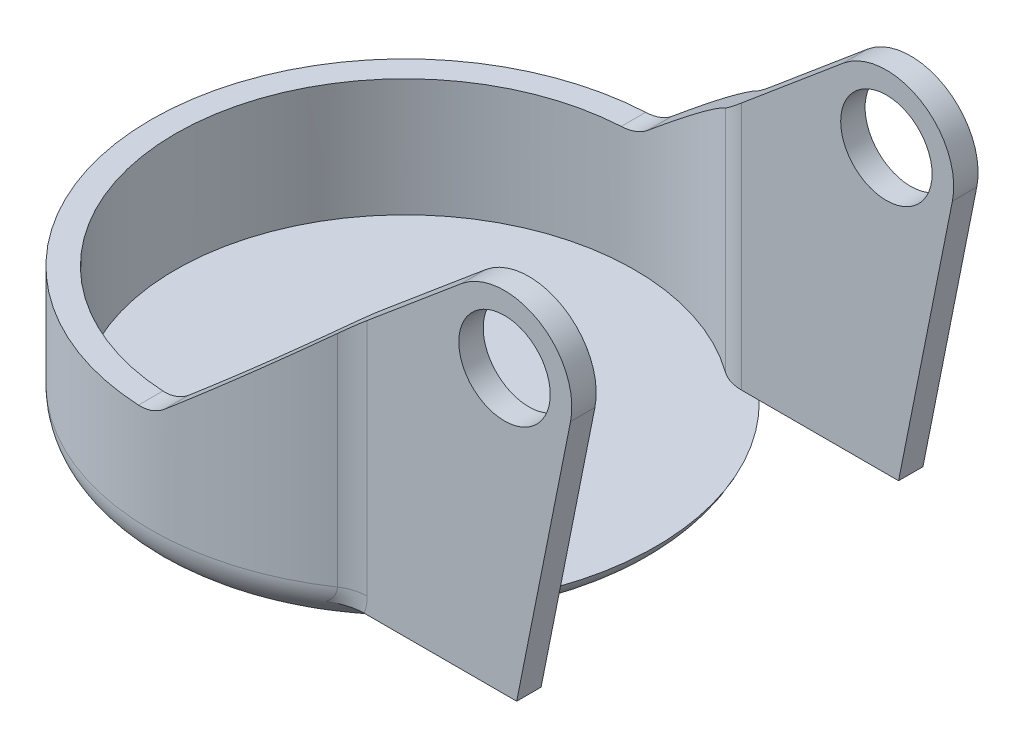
ISO-10303-21;
HEADER;
FILE_DESCRIPTION(('STEP AP214'),'2;1');
FILE_NAME('part.step','',(''),(''),'','','');
FILE_SCHEMA(('AUTOMOTIVE_DESIGN { 1 0 10303 214 1 1 1 1 }'));
ENDSEC;
DATA;
#1=APPLICATION_CONTEXT('core data for automotive mechanical design processes');
#2=APPLICATION_PROTOCOL_DEFINITION('international standard','automotive_design',2000,#1);
#3=PRODUCT_CONTEXT('',#1,'mechanical');
#4=PRODUCT('Part','Part','',(#3));
#5=PRODUCT_RELATED_PRODUCT_CATEGORY('part','',(#4));
#6=PRODUCT_DEFINITION_FORMATION('','',#4);
#7=PRODUCT_DEFINITION_CONTEXT('part definition',#1,'design');
#8=PRODUCT_DEFINITION('design','',#6,#7);
#9=PRODUCT_DEFINITION_SHAPE('','',#8);
#10=(LENGTH_UNIT() NAMED_UNIT(*) SI_UNIT(.MILLI.,.METRE.));
#11=(NAMED_UNIT(*) PLANE_ANGLE_UNIT() SI_UNIT($,.RADIAN.));
#12=(NAMED_UNIT(*) SI_UNIT($,.STERADIAN.) SOLID_ANGLE_UNIT());
#13=UNCERTAINTY_MEASURE_WITH_UNIT(LENGTH_MEASURE(1.E-05),#10,'distance_accuracy_value','');
#14=(GEOMETRIC_REPRESENTATION_CONTEXT(3) GLOBAL_UNCERTAINTY_ASSIGNED_CONTEXT((#13)) GLOBAL_UNIT_ASSIGNED_CONTEXT((#10,
#11,#12)) REPRESENTATION_CONTEXT('',''));
#15=CARTESIAN_POINT('',(0.,0.,0.));
#16=DIRECTION('',(0.,0.,1.));
#17=DIRECTION('',(1.,0.,0.));
#18=AXIS2_PLACEMENT_3D('',#15,#16,#17);
#19=CARTESIAN_POINT('',(0.,1.2,0.));
#20=DIRECTION('',(0.,-1.,0.));
#21=DIRECTION('',(0.,0.,-1.));
#22=AXIS2_PLACEMENT_3D('',#19,#20,#21);
#23=CYLINDRICAL_SURFACE('',#22,12.5);
#24=CARTESIAN_POINT('',(0.,6.92400870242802,0.));
#25=DIRECTION('',(0.64278760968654,-0.766044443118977,0.));
#26=DIRECTION('',(-0.766044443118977,-0.64278760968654,0.));
#27=AXIS2_PLACEMENT_3D('',#24,#25,#26);
#28=ELLIPSE('',#27,16.3175911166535,12.5);
#29=CARTESIAN_POINT('',(0.64819765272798,7.46791111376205,-12.4831822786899));
#30=VERTEX_POINT('',#29);
#31=CARTESIAN_POINT('',(7.01673301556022,12.8117467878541,-10.3448275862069));
#32=VERTEX_POINT('',#31);
#33=EDGE_CURVE('E239',#30,#32,#28,.T.);
#34=ORIENTED_EDGE('',*,*,#33,.T.);
#35=DIRECTION('',(0.,-1.,0.));
#36=VECTOR('',#35,1.);
#37=CARTESIAN_POINT('',(7.01673301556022,1.2,-10.3448275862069));
#38=LINE('',#37,#36);
#39=CARTESIAN_POINT('',(7.01673301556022,2.,-10.3448275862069));
#40=VERTEX_POINT('',#39);
#41=EDGE_CURVE('E419',#32,#40,#38,.T.);
#42=ORIENTED_EDGE('',*,*,#41,.T.);
#43=CARTESIAN_POINT('',(0.,2.,0.));
#44=DIRECTION('',(0.,1.,0.));
#45=DIRECTION('',(0.,0.,1.));
#46=AXIS2_PLACEMENT_3D('',#43,#44,#45);
#47=CIRCLE('',#46,12.5);
#48=CARTESIAN_POINT('',(7.01673301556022,2.,10.3448275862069));
#49=VERTEX_POINT('',#48);
#50=EDGE_CURVE('E300',#40,#49,#47,.T.);
#51=ORIENTED_EDGE('',*,*,#50,.T.);
#52=DIRECTION('',(0.,-1.,0.));
#53=VECTOR('',#52,1.);
#54=CARTESIAN_POINT('',(7.01673301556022,1.2,10.3448275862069));
#55=LINE('',#54,#53);
#56=CARTESIAN_POINT('',(7.01673301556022,12.8117467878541,10.3448275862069));
#57=VERTEX_POINT('',#56);
#58=EDGE_CURVE('E417',#49,#57,#55,.F.);
#59=ORIENTED_EDGE('',*,*,#58,.T.);
#60=CARTESIAN_POINT('',(0.64819765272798,7.46791111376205,12.4831822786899));
#61=VERTEX_POINT('',#60);
#62=EDGE_CURVE('E240',#57,#61,#28,.T.);
#63=ORIENTED_EDGE('',*,*,#62,.T.);
#64=CARTESIAN_POINT('',(0.648197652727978,7.46791111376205,12.4831822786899));
#65=CARTESIAN_POINT('',(0.604799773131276,7.43149949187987,12.4854357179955));
#66=CARTESIAN_POINT('',(0.559878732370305,7.3969476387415,12.4875408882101));
#67=CARTESIAN_POINT('',(0.467262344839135,7.33177220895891,12.4913498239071));
#68=CARTESIAN_POINT('',(0.419567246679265,7.30114828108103,12.4930536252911));
#69=CARTESIAN_POINT('',(0.275622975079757,7.2171677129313,12.4973201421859));
#70=CARTESIAN_POINT('',(0.175902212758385,7.16952353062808,12.4991832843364));
#71=CARTESIAN_POINT('',(0.0173507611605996,7.10925875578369,12.5001132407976));
#72=CARTESIAN_POINT('',(-0.0392796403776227,7.09059312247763,12.5000701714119));
#73=CARTESIAN_POINT('',(-0.154000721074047,7.05837944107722,12.4991826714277));
#74=CARTESIAN_POINT('',(-0.21209158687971,7.04483205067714,12.4983381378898));
#75=CARTESIAN_POINT('',(-0.331113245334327,7.02263214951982,12.4957597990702));
#76=CARTESIAN_POINT('',(-0.392075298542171,7.01415100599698,12.4939982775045));
#77=CARTESIAN_POINT('',(-0.514491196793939,7.00283039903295,12.4895590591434));
#78=CARTESIAN_POINT('',(-0.57594506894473,6.99999124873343,12.4868813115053));
#79=CARTESIAN_POINT('',(-0.637377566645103,7.,12.4837394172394));
#80=B_SPLINE_CURVE_WITH_KNOTS('',3,(#64,#65,#66,#67,#68,#69,#70,#71,#72,#73,#74,#75,#76,#77,#78,
#79),.UNSPECIFIED.,.F.,.F.,(4,2,2,2,2,2,2,4),(0.,0.169962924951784,0.33991064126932,
0.66971600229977,0.848404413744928,1.02711577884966,1.21157252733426,1.39603951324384),.UNSPECIFIED.);
#81=CARTESIAN_POINT('',(-0.637377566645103,7.,12.4837394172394));
#82=VERTEX_POINT('',#81);
#83=EDGE_CURVE('E489',#61,#82,#80,.T.);
#84=ORIENTED_EDGE('',*,*,#83,.T.);
#85=CARTESIAN_POINT('',(0.,7.,0.));
#86=DIRECTION('',(0.,-1.,0.));
#87=DIRECTION('',(0.,0.,-1.));
#88=AXIS2_PLACEMENT_3D('',#85,#86,#87);
#89=CIRCLE('',#88,12.5);
#90=CARTESIAN_POINT('',(-0.637377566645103,7.,-12.4837394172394));
#91=VERTEX_POINT('',#90);
#92=EDGE_CURVE('E263',#82,#91,#89,.T.);
#93=ORIENTED_EDGE('',*,*,#92,.T.);
#94=CARTESIAN_POINT('',(-0.637377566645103,7.,-12.4837394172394));
#95=CARTESIAN_POINT('',(-0.580944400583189,6.99999787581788,-12.4866232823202));
#96=CARTESIAN_POINT('',(-0.524513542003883,7.00238937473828,-12.4891178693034));
#97=CARTESIAN_POINT('',(-0.412035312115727,7.01193420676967,-12.4933334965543));
#98=CARTESIAN_POINT('',(-0.355987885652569,7.01908683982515,-12.4950546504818));
#99=CARTESIAN_POINT('',(-0.192258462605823,7.04708599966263,-12.4989874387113));
#100=CARTESIAN_POINT('',(-0.085607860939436,7.07448491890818,-12.5001370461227));
#101=CARTESIAN_POINT('',(0.131022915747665,7.14963845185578,-12.4998234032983));
#102=CARTESIAN_POINT('',(0.240453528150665,7.19898879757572,-12.4981183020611));
#103=CARTESIAN_POINT('',(0.398235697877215,7.28788823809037,-12.4937715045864));
#104=CARTESIAN_POINT('',(0.450546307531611,7.32064727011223,-12.4919807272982));
#105=CARTESIAN_POINT('',(0.551908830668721,7.39084039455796,-12.487912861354));
#106=CARTESIAN_POINT('',(0.600960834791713,7.42827435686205,-12.4856357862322));
#107=CARTESIAN_POINT('',(0.648197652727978,7.46791111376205,-12.4831822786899));
#108=B_SPLINE_CURVE_WITH_KNOTS('',3,(#94,#95,#96,#97,#98,#99,#100,#101,#102,#103,#104,#105,#106,
#107),.UNSPECIFIED.,.F.,.F.,(4,2,2,2,2,2,4),(0.,0.169424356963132,0.338823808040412,
0.667598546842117,1.02565764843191,1.21066859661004,1.39567439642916),.UNSPECIFIED.);
#109=EDGE_CURVE('E483',#91,#30,#108,.T.);
#110=ORIENTED_EDGE('',*,*,#109,.T.);
#111=EDGE_LOOP('',(#34,#42,#51,#59,#63,#84,#93,#110));
#112=FACE_BOUND('',#111,.T.);
#113=ADVANCED_FACE('F45',(#112),#23,.T.);
#114=CARTESIAN_POINT('',(0.,1.2,0.));
#115=DIRECTION('',(0.,1.,0.));
#116=DIRECTION('',(0.,0.,1.));
#117=AXIS2_PLACEMENT_3D('',#114,#115,#116);
#118=PLANE('',#117);
#119=CARTESIAN_POINT('',(0.,1.2,0.));
#120=DIRECTION('',(0.,1.,0.));
#121=DIRECTION('',(0.,0.,1.));
#122=AXIS2_PLACEMENT_3D('',#119,#120,#121);
#123=CIRCLE('',#122,2.5);
#124=CARTESIAN_POINT('',(0.,1.2,2.5));
#125=VERTEX_POINT('',#124);
#126=EDGE_CURVE('E533',#125,#125,#123,.T.);
#127=ORIENTED_EDGE('',*,*,#126,.F.);
#128=EDGE_LOOP('',(#127));
#129=FACE_BOUND('',#128,.T.);
#130=DIRECTION('',(-1.,0.,0.));
#131=VECTOR('',#130,1.);
#132=CARTESIAN_POINT('',(8.66477828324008,1.2,8.8));
#133=LINE('',#132,#131);
#134=CARTESIAN_POINT('',(8.64081222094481,1.2,8.8));
#135=VERTEX_POINT('',#134);
#136=CARTESIAN_POINT('',(7.76208734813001,1.2,8.8));
#137=VERTEX_POINT('',#136);
#138=EDGE_CURVE('E284',#135,#137,#133,.T.);
#139=ORIENTED_EDGE('',*,*,#138,.F.);
#140=CARTESIAN_POINT('',(0.,1.2,0.));
#141=DIRECTION('',(0.,1.,0.));
#142=DIRECTION('',(0.,0.,1.));
#143=AXIS2_PLACEMENT_3D('',#140,#141,#142);
#144=CIRCLE('',#143,12.3330302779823);
#145=CARTESIAN_POINT('',(8.64081222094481,1.2,-8.8));
#146=VERTEX_POINT('',#145);
#147=EDGE_CURVE('E303',#135,#146,#144,.T.);
#148=ORIENTED_EDGE('',*,*,#147,.T.);
#149=DIRECTION('',(1.,0.,0.));
#150=VECTOR('',#149,1.);
#151=CARTESIAN_POINT('',(7.08872343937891,1.2,-8.8));
#152=LINE('',#151,#150);
#153=CARTESIAN_POINT('',(7.76208734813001,1.2,-8.8));
#154=VERTEX_POINT('',#153);
#155=EDGE_CURVE('E288',#154,#146,#152,.T.);
#156=ORIENTED_EDGE('',*,*,#155,.F.);
#157=CARTESIAN_POINT('',(7.76208734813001,1.2,-10.8));
#158=DIRECTION('',(0.,1.,0.));
#159=DIRECTION('',(0.,0.,1.));
#160=AXIS2_PLACEMENT_3D('',#157,#158,#159);
#161=CIRCLE('',#160,2.);
#162=CARTESIAN_POINT('',(6.59485616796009,1.2,-9.17593984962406));
#163=VERTEX_POINT('',#162);
#164=EDGE_CURVE('E67',#154,#163,#161,.F.);
#165=ORIENTED_EDGE('',*,*,#164,.T.);
#166=CARTESIAN_POINT('',(0.,1.2,0.));
#167=DIRECTION('',(0.,-1.,0.));
#168=DIRECTION('',(0.,0.,1.));
#169=AXIS2_PLACEMENT_3D('',#166,#167,#168);
#170=CIRCLE('',#169,11.3);
#171=CARTESIAN_POINT('',(6.59485616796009,1.2,9.17593984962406));
#172=VERTEX_POINT('',#171);
#173=EDGE_CURVE('E283',#172,#163,#170,.T.);
#174=ORIENTED_EDGE('',*,*,#173,.F.);
#175=CARTESIAN_POINT('',(7.76208734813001,1.2,10.8));
#176=DIRECTION('',(0.,1.,0.));
#177=DIRECTION('',(0.,0.,1.));
#178=AXIS2_PLACEMENT_3D('',#175,#176,#177);
#179=CIRCLE('',#178,2.);
#180=EDGE_CURVE('E75',#172,#137,#179,.F.);
#181=ORIENTED_EDGE('',*,*,#180,.T.);
#182=EDGE_LOOP('',(#139,#148,#156,#165,#174,#181));
#183=FACE_BOUND('',#182,.T.);
#184=ADVANCED_FACE('F382',(#129,#183),#118,.T.);
#185=CARTESIAN_POINT('',(0.,0.,0.));
#186=DIRECTION('',(0.,1.,0.));
#187=DIRECTION('',(0.,0.,1.));
#188=AXIS2_PLACEMENT_3D('',#185,#186,#187);
#189=PLANE('',#188);
#190=CARTESIAN_POINT('',(0.,0.,0.));
#191=DIRECTION('',(0.,-1.,0.));
#192=DIRECTION('',(0.,0.,-1.));
#193=AXIS2_PLACEMENT_3D('',#190,#191,#192);
#194=CIRCLE('',#193,2.5);
#195=CARTESIAN_POINT('',(0.,0.,-2.5));
#196=VERTEX_POINT('',#195);
#197=EDGE_CURVE('E537',#196,#196,#194,.T.);
#198=ORIENTED_EDGE('',*,*,#197,.F.);
#199=EDGE_LOOP('',(#198));
#200=FACE_BOUND('',#199,.T.);
#201=CARTESIAN_POINT('',(0.,0.,0.));
#202=DIRECTION('',(0.,1.,0.));
#203=DIRECTION('',(0.,0.,1.));
#204=AXIS2_PLACEMENT_3D('',#201,#202,#203);
#205=CIRCLE('',#204,10.5);
#206=CARTESIAN_POINT('',(0.,0.,10.5));
#207=VERTEX_POINT('',#206);
#208=EDGE_CURVE('E306',#207,#207,#205,.F.);
#209=ORIENTED_EDGE('',*,*,#208,.T.);
#210=EDGE_LOOP('',(#209));
#211=FACE_BOUND('',#210,.T.);
#212=ADVANCED_FACE('F435',(#200,#211),#189,.F.);
#213=CARTESIAN_POINT('',(0.,1.2,0.));
#214=DIRECTION('',(0.,1.,0.));
#215=DIRECTION('',(0.,0.,1.));
#216=AXIS2_PLACEMENT_3D('',#213,#214,#215);
#217=PLANE('',#216);
#218=DIRECTION('',(1.,0.,0.));
#219=VECTOR('',#218,1.);
#220=CARTESIAN_POINT('',(7.5,1.2,10.));
#221=LINE('',#220,#219);
#222=CARTESIAN_POINT('',(7.99455160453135,1.2,10.));
#223=VERTEX_POINT('',#222);
#224=CARTESIAN_POINT('',(15.5,1.2,10.));
#225=VERTEX_POINT('',#224);
#226=EDGE_CURVE('E276',#223,#225,#221,.T.);
#227=ORIENTED_EDGE('',*,*,#226,.F.);
#228=CARTESIAN_POINT('',(7.93916869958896,2.93764128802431,10.));
#229=CARTESIAN_POINT('',(7.34671416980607,2.67873298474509,10.));
#230=CARTESIAN_POINT('',(6.86637609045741,2.46882064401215,10.3784811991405));
#231=CARTESIAN_POINT('',(7.96564734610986,2.87708508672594,10.));
#232=CARTESIAN_POINT('',(7.37030622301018,2.63524514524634,10.));
#233=CARTESIAN_POINT('',(6.88633456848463,2.4385425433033,10.3740351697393));
#234=CARTESIAN_POINT('',(7.98975331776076,2.815471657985,10.));
#235=CARTESIAN_POINT('',(7.39179481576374,2.59086525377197,10.));
#236=CARTESIAN_POINT('',(6.90447537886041,2.40773582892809,10.3699858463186));
#237=CARTESIAN_POINT('',(8.03291083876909,2.69042899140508,10.));
#238=CARTESIAN_POINT('',(7.43025127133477,2.50064731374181,10.));
#239=CARTESIAN_POINT('',(6.9369167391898,2.34521449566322,10.3627342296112));
#240=CARTESIAN_POINT('',(8.05195700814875,2.62699789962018,10.));
#241=CARTESIAN_POINT('',(7.44722341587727,2.45479848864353,10.));
#242=CARTESIAN_POINT('',(6.9512132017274,2.31349894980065,10.3595328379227));
#243=CARTESIAN_POINT('',(8.08450391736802,2.49923683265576,10.));
#244=CARTESIAN_POINT('',(7.47621523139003,2.36233782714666,10.));
#245=CARTESIAN_POINT('',(6.97562438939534,2.24961841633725,10.3540612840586));
#246=CARTESIAN_POINT('',(8.09804579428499,2.43491738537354,10.));
#247=CARTESIAN_POINT('',(7.488278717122,2.31572414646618,10.));
#248=CARTESIAN_POINT('',(6.98577013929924,2.21745869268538,10.3517842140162));
#249=CARTESIAN_POINT('',(8.1195422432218,2.30539847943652,10.));
#250=CARTESIAN_POINT('',(7.50742207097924,2.22179000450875,10.));
#251=CARTESIAN_POINT('',(7.00186810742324,2.15269923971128,10.3481692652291));
#252=CARTESIAN_POINT('',(8.127501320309,2.24019977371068,10.));
#253=CARTESIAN_POINT('',(7.51451087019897,2.17445847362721,10.));
#254=CARTESIAN_POINT('',(7.00782370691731,2.12009988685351,10.346830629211));
#255=CARTESIAN_POINT('',(8.13713618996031,2.11664033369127,10.));
#256=CARTESIAN_POINT('',(7.52309005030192,2.08473370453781,10.));
#257=CARTESIAN_POINT('',(7.01503220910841,2.05832016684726,10.3452101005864));
#258=CARTESIAN_POINT('',(8.13941209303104,2.0583251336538,10.));
#259=CARTESIAN_POINT('',(7.52511687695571,2.04236816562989,10.));
#260=CARTESIAN_POINT('',(7.01673427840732,2.02916256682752,10.3448272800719));
#261=CARTESIAN_POINT('',(8.13940797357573,1.92446981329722,10.));
#262=CARTESIAN_POINT('',(7.5251129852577,1.94513384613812,10.));
#263=CARTESIAN_POINT('',(7.01673138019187,1.9622349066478,10.3448279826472));
#264=CARTESIAN_POINT('',(8.13558597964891,1.84892296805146,10.));
#265=CARTESIAN_POINT('',(7.52170886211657,1.89024619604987,10.));
#266=CARTESIAN_POINT('',(7.01387327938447,1.92446148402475,10.3454708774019));
#267=CARTESIAN_POINT('',(8.1204072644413,1.69857345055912,10.));
#268=CARTESIAN_POINT('',(7.50819361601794,1.78109435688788,10.));
#269=CARTESIAN_POINT('',(7.00251458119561,1.8492867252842,10.3480237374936));
#270=CARTESIAN_POINT('',(8.10904557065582,1.62377130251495,10.));
#271=CARTESIAN_POINT('',(7.49807337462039,1.7268118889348,10.));
#272=CARTESIAN_POINT('',(6.99401026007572,1.81188565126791,10.3499345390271));
#273=CARTESIAN_POINT('',(8.06394165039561,1.40133037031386,10.));
#274=CARTESIAN_POINT('',(7.45788711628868,1.5655591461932,10.));
#275=CARTESIAN_POINT('',(6.96021584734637,1.70066518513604,10.3575187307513));
#276=CARTESIAN_POINT('',(8.01918126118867,1.25579997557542,10.));
#277=CARTESIAN_POINT('',(7.41796622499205,1.46029554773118,10.));
#278=CARTESIAN_POINT('',(6.92664474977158,1.62789998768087,10.3650437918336));
#279=CARTESIAN_POINT('',(7.90487369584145,0.976916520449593,10.));
#280=CARTESIAN_POINT('',(7.31608123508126,1.25963370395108,10.));
#281=CARTESIAN_POINT('',(6.84055353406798,1.48845826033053,10.3842414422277));
#282=CARTESIAN_POINT('',(7.83558764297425,0.843453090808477,10.));
#283=CARTESIAN_POINT('',(7.25423018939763,1.16404838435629,10.));
#284=CARTESIAN_POINT('',(6.78823297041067,1.42172654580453,10.3958703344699));
#285=CARTESIAN_POINT('',(7.67666909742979,0.58886302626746,10.));
#286=CARTESIAN_POINT('',(7.11237967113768,0.983001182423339,10.));
#287=CARTESIAN_POINT('',(6.66759004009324,1.29443151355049,10.422490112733));
#288=CARTESIAN_POINT('',(7.58697632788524,0.467774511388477,10.));
#289=CARTESIAN_POINT('',(7.03219232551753,0.897523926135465,10.));
#290=CARTESIAN_POINT('',(6.59922024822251,1.23388725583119,10.4374909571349));
#291=CARTESIAN_POINT('',(7.34899555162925,0.188762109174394,10.));
#292=CARTESIAN_POINT('',(6.81918060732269,0.702205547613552,10.));
#293=CARTESIAN_POINT('',(6.41665390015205,1.09438105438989,10.4771658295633));
#294=CARTESIAN_POINT('',(7.19230362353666,0.0381194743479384,10.));
#295=CARTESIAN_POINT('',(6.67871071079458,0.598491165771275,10.));
#296=CARTESIAN_POINT('',(6.29553945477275,1.01905973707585,10.5031895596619));
#297=CARTESIAN_POINT('',(6.85874035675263,-0.235160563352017,10.));
#298=CARTESIAN_POINT('',(6.37932155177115,0.413481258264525,10.));
#299=CARTESIAN_POINT('',(6.03500042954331,0.882419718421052,10.5580898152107));
#300=CARTESIAN_POINT('',(6.68210453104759,-0.358082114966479,10.));
#301=CARTESIAN_POINT('',(6.22030004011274,0.332024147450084,10.));
#302=CARTESIAN_POINT('',(5.89578710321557,0.820958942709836,10.5869325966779));
#303=CARTESIAN_POINT('',(6.49976966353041,-0.468788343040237,10.));
#304=CARTESIAN_POINT('',(6.05678049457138,0.260828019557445,10.));
#305=CARTESIAN_POINT('',(5.75030285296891,0.765605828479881,10.6163199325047));
#306=(BOUNDED_SURFACE() B_SPLINE_SURFACE(3,2,((#228,#229,#230),(#231,#232,#233),(#234,#235,
#236),(#237,#238,#239),(#240,#241,#242),(#243,#244,#245),(#246,#247,#248),(#249,#250,#251),
(#252,#253,#254),(#255,#256,#257),(#258,#259,#260),(#261,#262,#263),(#264,#265,#266),(#267,#268,
#269),(#270,#271,#272),(#273,#274,#275),(#276,#277,#278),(#279,#280,#281),(#282,#283,#284),
(#285,#286,#287),(#288,#289,#290),(#291,#292,#293),(#294,#295,#296),(#297,#298,#299),(#300,#301,
#302),(#303,#304,#305)),.UNSPECIFIED.,.F.,.F.,.F.) B_SPLINE_SURFACE_WITH_KNOTS((4,2,2,2,2,2,2,2,
2,2,2,2,4),(3,3),(0.,0.198253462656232,0.396716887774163,0.593668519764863,0.790461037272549,
0.965377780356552,1.19189237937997,1.41855651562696,1.8723058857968,2.32136274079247,
2.77176363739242,3.42063825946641,4.06252434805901),(0.,1.),
.UNSPECIFIED.) GEOMETRIC_REPRESENTATION_ITEM() RATIONAL_B_SPLINE_SURFACE(((1.,0.951514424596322,
1.),(1.,0.952098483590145,1.),(1.,0.952629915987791,1.),(1.,0.953580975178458,1.),(1.,
0.95400048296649,1.),(1.,0.954717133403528,1.),(1.,0.955015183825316,1.),(1.,0.955488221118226,
1.),(1.,0.955663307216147,1.),(1.,0.955875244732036,1.),(1.,0.95592529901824,1.),(1.,
0.955925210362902,1.),(1.,0.955841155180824,1.),(1.,0.9555072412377,1.),(1.,0.95525727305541,
1.),(1.,0.954264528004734,1.),(1.,0.953278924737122,1.),(1.,0.95075820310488,1.),(1.,
0.949228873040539,1.),(1.,0.945716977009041,1.),(1.,0.943733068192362,1.),(1.,0.938465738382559,
1.),(1.,0.934994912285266,1.),(1.,0.927626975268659,1.),(1.,0.923734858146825,1.),(1.,
0.919739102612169,1.))) REPRESENTATION_ITEM('') SURFACE());
#307=CARTESIAN_POINT('',(7.99455160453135,1.2,10.));
#308=CARTESIAN_POINT('',(7.92614486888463,1.2,9.99998524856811));
#309=CARTESIAN_POINT('',(7.85776231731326,1.2,10.0030887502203));
#310=CARTESIAN_POINT('',(7.72158451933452,1.2,10.015224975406));
#311=CARTESIAN_POINT('',(7.65378879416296,1.2,10.0242522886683));
#312=CARTESIAN_POINT('',(7.52055385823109,1.2,10.0476912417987));
#313=CARTESIAN_POINT('',(7.45509469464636,1.2,10.061990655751));
#314=CARTESIAN_POINT('',(7.32548612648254,1.2,10.0956244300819));
#315=CARTESIAN_POINT('',(7.2613368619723,1.2,10.1149593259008));
#316=CARTESIAN_POINT('',(7.08606711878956,1.2,10.1748658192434));
#317=CARTESIAN_POINT('',(6.97662182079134,1.2,10.2203573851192));
#318=CARTESIAN_POINT('',(6.76163104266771,1.2,10.3244658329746));
#319=CARTESIAN_POINT('',(6.65619412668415,1.2,10.3833084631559));
#320=CARTESIAN_POINT('',(6.55428273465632,1.2,10.4472490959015));
#321=B_SPLINE_CURVE_WITH_KNOTS('',3,(#307,#308,#309,#310,#311,#312,#313,#314,#315,#316,#317,
#318,#319,#320),.UNSPECIFIED.,.F.,.F.,(4,2,2,2,2,2,4),(0.,0.205113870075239,0.410040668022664,
0.610835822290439,0.811652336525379,1.16635363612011,1.52757041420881),.UNSPECIFIED.);
#322=CARTESIAN_POINT('',(6.55428273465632,1.19999999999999,10.4472490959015));
#323=VERTEX_POINT('',#322);
#324=EDGE_CURVE('E426',#223,#323,#321,.T.);
#325=ORIENTED_EDGE('',*,*,#324,.T.);
#326=CARTESIAN_POINT('',(0.,1.2,0.));
#327=DIRECTION('',(0.,1.,0.));
#328=DIRECTION('',(0.,0.,1.));
#329=AXIS2_PLACEMENT_3D('',#326,#327,#328);
#330=CIRCLE('',#329,12.3330302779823);
#331=EDGE_CURVE('E309',#323,#135,#330,.T.);
#332=ORIENTED_EDGE('',*,*,#331,.T.);
#333=CARTESIAN_POINT('',(15.5,1.2,8.8));
#334=VERTEX_POINT('',#333);
#335=EDGE_CURVE('E281',#334,#135,#133,.T.);
#336=ORIENTED_EDGE('',*,*,#335,.F.);
#337=DIRECTION('',(0.,0.,-1.));
#338=VECTOR('',#337,1.);
#339=CARTESIAN_POINT('',(15.5,1.2,8.8));
#340=LINE('',#339,#338);
#341=EDGE_CURVE('E278',#225,#334,#340,.T.);
#342=ORIENTED_EDGE('',*,*,#341,.F.);
#343=EDGE_LOOP('',(#227,#325,#332,#336,#342));
#344=FACE_BOUND('',#343,.T.);
#345=ADVANCED_FACE('F431',(#344),#217,.F.);
#346=CARTESIAN_POINT('',(15.5,1.2,-8.8));
#347=VERTEX_POINT('',#346);
#348=EDGE_CURVE('E287',#146,#347,#152,.T.);
#349=ORIENTED_EDGE('',*,*,#348,.F.);
#350=CARTESIAN_POINT('',(0.,1.2,0.));
#351=DIRECTION('',(0.,1.,0.));
#352=DIRECTION('',(0.,0.,1.));
#353=AXIS2_PLACEMENT_3D('',#350,#351,#352);
#354=CIRCLE('',#353,12.3330302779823);
#355=CARTESIAN_POINT('',(6.55428273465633,1.2,-10.4472490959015));
#356=VERTEX_POINT('',#355);
#357=EDGE_CURVE('E312',#146,#356,#354,.T.);
#358=ORIENTED_EDGE('',*,*,#357,.T.);
#359=CARTESIAN_POINT('',(6.86637609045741,2.46882064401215,-10.3784811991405));
#360=CARTESIAN_POINT('',(7.34671416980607,2.67873298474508,-10.));
#361=CARTESIAN_POINT('',(7.93916869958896,2.93764128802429,-10.));
#362=CARTESIAN_POINT('',(6.88633456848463,2.4385425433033,-10.3740351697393));
#363=CARTESIAN_POINT('',(7.37030622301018,2.63524514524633,-10.));
#364=CARTESIAN_POINT('',(7.96564734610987,2.87708508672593,-10.));
#365=CARTESIAN_POINT('',(6.90447537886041,2.40773582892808,-10.3699858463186));
#366=CARTESIAN_POINT('',(7.39179481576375,2.59086525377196,-10.));
#367=CARTESIAN_POINT('',(7.98975331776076,2.81547165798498,-10.));
#368=CARTESIAN_POINT('',(6.9369167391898,2.34521449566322,-10.3627342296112));
#369=CARTESIAN_POINT('',(7.43025127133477,2.5006473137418,-10.));
#370=CARTESIAN_POINT('',(8.03291083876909,2.69042899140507,-10.));
#371=CARTESIAN_POINT('',(6.9512132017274,2.31349894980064,-10.3595328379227));
#372=CARTESIAN_POINT('',(7.44722341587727,2.45479848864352,-10.));
#373=CARTESIAN_POINT('',(8.05195700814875,2.62699789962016,-10.));
#374=CARTESIAN_POINT('',(6.97562438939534,2.24961841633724,-10.3540612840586));
#375=CARTESIAN_POINT('',(7.47621523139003,2.36233782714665,-10.));
#376=CARTESIAN_POINT('',(8.08450391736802,2.49923683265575,-10.));
#377=CARTESIAN_POINT('',(6.98577013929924,2.21745869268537,-10.3517842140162));
#378=CARTESIAN_POINT('',(7.488278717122,2.31572414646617,-10.));
#379=CARTESIAN_POINT('',(8.09804579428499,2.43491738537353,-10.));
#380=CARTESIAN_POINT('',(7.00186810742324,2.15269923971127,-10.3481692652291));
#381=CARTESIAN_POINT('',(7.50742207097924,2.22179000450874,-10.));
#382=CARTESIAN_POINT('',(8.1195422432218,2.30539847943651,-10.));
#383=CARTESIAN_POINT('',(7.00782370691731,2.1200998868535,-10.346830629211));
#384=CARTESIAN_POINT('',(7.51451087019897,2.1744584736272,-10.));
#385=CARTESIAN_POINT('',(8.12750132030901,2.24019977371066,-10.));
#386=CARTESIAN_POINT('',(7.01503220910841,2.05832016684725,-10.3452101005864));
#387=CARTESIAN_POINT('',(7.52309005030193,2.08473370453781,-10.));
#388=CARTESIAN_POINT('',(8.13713618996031,2.11664033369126,-10.));
#389=CARTESIAN_POINT('',(7.01673427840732,2.02916256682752,-10.3448272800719));
#390=CARTESIAN_POINT('',(7.52511687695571,2.04236816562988,-10.));
#391=CARTESIAN_POINT('',(8.13941209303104,2.0583251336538,-10.));
#392=CARTESIAN_POINT('',(7.01673138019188,1.9622349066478,-10.3448279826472));
#393=CARTESIAN_POINT('',(7.5251129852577,1.94513384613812,-10.));
#394=CARTESIAN_POINT('',(8.13940797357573,1.92446981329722,-10.));
#395=CARTESIAN_POINT('',(7.01387327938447,1.92446148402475,-10.3454708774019));
#396=CARTESIAN_POINT('',(7.52170886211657,1.89024619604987,-10.));
#397=CARTESIAN_POINT('',(8.13558597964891,1.84892296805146,-10.));
#398=CARTESIAN_POINT('',(7.00251458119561,1.8492867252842,-10.3480237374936));
#399=CARTESIAN_POINT('',(7.50819361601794,1.78109435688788,-10.));
#400=CARTESIAN_POINT('',(8.1204072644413,1.69857345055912,-10.));
#401=CARTESIAN_POINT('',(6.99401026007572,1.81188565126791,-10.3499345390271));
#402=CARTESIAN_POINT('',(7.49807337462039,1.7268118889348,-10.));
#403=CARTESIAN_POINT('',(8.10904557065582,1.62377130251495,-10.));
#404=CARTESIAN_POINT('',(6.96021584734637,1.70066518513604,-10.3575187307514));
#405=CARTESIAN_POINT('',(7.45788711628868,1.5655591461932,-10.));
#406=CARTESIAN_POINT('',(8.06394165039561,1.40133037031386,-10.));
#407=CARTESIAN_POINT('',(6.92664474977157,1.62789998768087,-10.3650437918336));
#408=CARTESIAN_POINT('',(7.41796622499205,1.46029554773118,-10.));
#409=CARTESIAN_POINT('',(8.01918126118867,1.25579997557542,-10.));
#410=CARTESIAN_POINT('',(6.84055353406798,1.48845826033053,-10.3842414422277));
#411=CARTESIAN_POINT('',(7.31608123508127,1.25963370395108,-10.));
#412=CARTESIAN_POINT('',(7.90487369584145,0.976916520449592,-10.));
#413=CARTESIAN_POINT('',(6.78823297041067,1.42172654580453,-10.3958703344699));
#414=CARTESIAN_POINT('',(7.25423018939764,1.16404838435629,-10.));
#415=CARTESIAN_POINT('',(7.83558764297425,0.843453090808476,-10.));
#416=CARTESIAN_POINT('',(6.66759004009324,1.29443151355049,-10.422490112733));
#417=CARTESIAN_POINT('',(7.11237967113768,0.983001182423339,-10.));
#418=CARTESIAN_POINT('',(7.67666909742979,0.588863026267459,-10.));
#419=CARTESIAN_POINT('',(6.59922024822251,1.23388725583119,-10.4374909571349));
#420=CARTESIAN_POINT('',(7.03219232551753,0.897523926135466,-10.));
#421=CARTESIAN_POINT('',(7.58697632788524,0.467774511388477,-10.));
#422=CARTESIAN_POINT('',(6.41665390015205,1.09438105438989,-10.4771658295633));
#423=CARTESIAN_POINT('',(6.81918060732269,0.702205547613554,-10.));
#424=CARTESIAN_POINT('',(7.34899555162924,0.188762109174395,-10.));
#425=CARTESIAN_POINT('',(6.29553945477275,1.01905973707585,-10.5031895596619));
#426=CARTESIAN_POINT('',(6.67871071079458,0.598491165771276,-10.));
#427=CARTESIAN_POINT('',(7.19230362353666,0.0381194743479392,-10.));
#428=CARTESIAN_POINT('',(6.03500042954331,0.882419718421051,-10.5580898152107));
#429=CARTESIAN_POINT('',(6.37932155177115,0.413481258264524,-10.));
#430=CARTESIAN_POINT('',(6.85874035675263,-0.235160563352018,-10.));
#431=CARTESIAN_POINT('',(5.89578710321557,0.820958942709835,-10.5869325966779));
#432=CARTESIAN_POINT('',(6.22030004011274,0.332024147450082,-10.));
#433=CARTESIAN_POINT('',(6.68210453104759,-0.35808211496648,-10.));
#434=CARTESIAN_POINT('',(5.75030285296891,0.765605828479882,-10.6163199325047));
#435=CARTESIAN_POINT('',(6.05678049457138,0.260828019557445,-10.));
#436=CARTESIAN_POINT('',(6.49976966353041,-0.468788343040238,-10.));
#437=(BOUNDED_SURFACE() B_SPLINE_SURFACE(3,2,((#359,#360,#361),(#362,#363,#364),(#365,#366,
#367),(#368,#369,#370),(#371,#372,#373),(#374,#375,#376),(#377,#378,#379),(#380,#381,#382),
(#383,#384,#385),(#386,#387,#388),(#389,#390,#391),(#392,#393,#394),(#395,#396,#397),(#398,#399,
#400),(#401,#402,#403),(#404,#405,#406),(#407,#408,#409),(#410,#411,#412),(#413,#414,#415),
(#416,#417,#418),(#419,#420,#421),(#422,#423,#424),(#425,#426,#427),(#428,#429,#430),(#431,#432,
#433),(#434,#435,#436)),.UNSPECIFIED.,.F.,.F.,.F.) B_SPLINE_SURFACE_WITH_KNOTS((4,2,2,2,2,2,2,2,
2,2,2,2,4),(3,3),(0.,0.198253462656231,0.396716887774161,0.593668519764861,0.790461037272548,
0.965377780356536,1.19189237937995,1.41855651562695,1.87230588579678,2.32136274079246,
2.77176363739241,3.4206382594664,4.06252434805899),(0.,1.),
.UNSPECIFIED.) GEOMETRIC_REPRESENTATION_ITEM() RATIONAL_B_SPLINE_SURFACE(((1.,0.951514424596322,
1.),(1.,0.952098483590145,1.),(1.,0.952629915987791,1.),(1.,0.953580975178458,1.),(1.,
0.95400048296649,1.),(1.,0.954717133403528,1.),(1.,0.955015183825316,1.),(1.,0.955488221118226,
1.),(1.,0.955663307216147,1.),(1.,0.955875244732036,1.),(1.,0.95592529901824,1.),(1.,
0.955925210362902,1.),(1.,0.955841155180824,1.),(1.,0.9555072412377,1.),(1.,0.95525727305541,
1.),(1.,0.954264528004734,1.),(1.,0.953278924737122,1.),(1.,0.95075820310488,1.),(1.,
0.949228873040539,1.),(1.,0.945716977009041,1.),(1.,0.943733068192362,1.),(1.,0.938465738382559,
1.),(1.,0.934994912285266,1.),(1.,0.927626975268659,1.),(1.,0.923734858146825,1.),(1.,
0.919739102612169,1.))) REPRESENTATION_ITEM('') SURFACE());
#438=CARTESIAN_POINT('',(6.55428273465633,1.2,-10.4472490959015));
#439=CARTESIAN_POINT('',(6.62973693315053,1.2,-10.3999247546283));
#440=CARTESIAN_POINT('',(6.70703732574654,1.2,-10.3554212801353));
#441=CARTESIAN_POINT('',(6.86526919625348,1.2,-10.2728851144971));
#442=CARTESIAN_POINT('',(6.94620976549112,1.2,-10.2348699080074));
#443=CARTESIAN_POINT('',(7.10891468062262,1.2,-10.167372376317));
#444=CARTESIAN_POINT('',(7.19059041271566,1.2,-10.1376784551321));
#445=CARTESIAN_POINT('',(7.35634875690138,1.2,-10.0863935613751));
#446=CARTESIAN_POINT('',(7.44042791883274,1.2,-10.0647915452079));
#447=CARTESIAN_POINT('',(7.6020792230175,1.2,-10.0321496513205));
#448=CARTESIAN_POINT('',(7.67948342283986,1.2,-10.0202833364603));
#449=CARTESIAN_POINT('',(7.83608560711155,1.2,-10.0041466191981));
#450=CARTESIAN_POINT('',(7.91529384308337,1.2,-9.99997646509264));
#451=CARTESIAN_POINT('',(7.99455160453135,1.2,-10.));
#452=B_SPLINE_CURVE_WITH_KNOTS('',3,(#438,#439,#440,#441,#442,#443,#444,#445,#446,#447,#448,
#449,#450,#451),.UNSPECIFIED.,.F.,.F.,(4,2,2,2,2,2,4),(0.,0.267236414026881,0.535181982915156,
0.795521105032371,1.05550361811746,1.29005656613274,1.52764374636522),.UNSPECIFIED.);
#453=CARTESIAN_POINT('',(7.99455160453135,1.2,-10.));
#454=VERTEX_POINT('',#453);
#455=EDGE_CURVE('E421',#356,#454,#452,.T.);
#456=ORIENTED_EDGE('',*,*,#455,.T.);
#457=DIRECTION('',(-1.,0.,0.));
#458=VECTOR('',#457,1.);
#459=CARTESIAN_POINT('',(7.5,1.2,-10.));
#460=LINE('',#459,#458);
#461=CARTESIAN_POINT('',(15.5,1.2,-10.));
#462=VERTEX_POINT('',#461);
#463=EDGE_CURVE('E293',#462,#454,#460,.T.);
#464=ORIENTED_EDGE('',*,*,#463,.F.);
#465=DIRECTION('',(0.,0.,-1.));
#466=VECTOR('',#465,1.);
#467=CARTESIAN_POINT('',(15.5,1.2,-10.));
#468=LINE('',#467,#466);
#469=EDGE_CURVE('E290',#347,#462,#468,.T.);
#470=ORIENTED_EDGE('',*,*,#469,.F.);
#471=EDGE_LOOP('',(#349,#358,#456,#464,#470));
#472=FACE_BOUND('',#471,.T.);
#473=ADVANCED_FACE('F379',(#472),#217,.F.);
#474=CARTESIAN_POINT('',(7.5,21.2,10.));
#475=DIRECTION('',(0.,0.,-1.));
#476=DIRECTION('',(-1.,0.,0.));
#477=AXIS2_PLACEMENT_3D('',#474,#475,#476);
#478=PLANE('',#477);
#479=CARTESIAN_POINT('',(14.9,15.1,10.));
#480=DIRECTION('',(0.,0.,-1.));
#481=DIRECTION('',(-1.,0.,0.));
#482=AXIS2_PLACEMENT_3D('',#479,#480,#481);
#483=CIRCLE('',#482,2.25);
#484=CARTESIAN_POINT('',(12.65,15.1,10.));
#485=VERTEX_POINT('',#484);
#486=EDGE_CURVE('E260',#485,#485,#483,.T.);
#487=ORIENTED_EDGE('',*,*,#486,.T.);
#488=EDGE_LOOP('',(#487));
#489=FACE_BOUND('',#488,.T.);
#490=DIRECTION('',(0.,1.,0.));
#491=VECTOR('',#490,1.);
#492=CARTESIAN_POINT('',(8.13941029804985,2.,10.));
#493=LINE('',#492,#491);
#494=CARTESIAN_POINT('',(8.13941029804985,13.7537848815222,10.));
#495=VERTEX_POINT('',#494);
#496=CARTESIAN_POINT('',(8.13941029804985,2.,10.));
#497=VERTEX_POINT('',#496);
#498=EDGE_CURVE('E394',#495,#497,#493,.F.);
#499=ORIENTED_EDGE('',*,*,#498,.T.);
#500=CARTESIAN_POINT('',(7.93916869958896,2.93764128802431,10.));
#501=CARTESIAN_POINT('',(7.96564734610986,2.87708508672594,10.));
#502=CARTESIAN_POINT('',(7.98975331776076,2.815471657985,10.));
#503=CARTESIAN_POINT('',(8.03291083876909,2.69042899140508,10.));
#504=CARTESIAN_POINT('',(8.05195700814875,2.62699789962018,10.));
#505=CARTESIAN_POINT('',(8.08450391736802,2.49923683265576,10.));
#506=CARTESIAN_POINT('',(8.09804579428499,2.43491738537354,10.));
#507=CARTESIAN_POINT('',(8.11954224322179,2.30539847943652,10.));
#508=CARTESIAN_POINT('',(8.127501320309,2.24019977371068,10.));
#509=CARTESIAN_POINT('',(8.13713618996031,2.11664033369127,10.));
#510=CARTESIAN_POINT('',(8.13941209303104,2.0583251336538,10.));
#511=CARTESIAN_POINT('',(8.13940797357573,1.92446981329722,10.));
#512=CARTESIAN_POINT('',(8.13558597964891,1.84892296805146,10.));
#513=CARTESIAN_POINT('',(8.1204072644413,1.69857345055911,10.));
#514=CARTESIAN_POINT('',(8.10904557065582,1.62377130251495,10.));
#515=CARTESIAN_POINT('',(8.06394165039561,1.40133037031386,10.));
#516=CARTESIAN_POINT('',(8.01918126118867,1.25579997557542,10.));
#517=CARTESIAN_POINT('',(7.90487369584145,0.976916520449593,10.));
#518=CARTESIAN_POINT('',(7.83558764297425,0.843453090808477,10.));
#519=CARTESIAN_POINT('',(7.67666909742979,0.58886302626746,10.));
#520=CARTESIAN_POINT('',(7.58697632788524,0.467774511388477,10.));
#521=CARTESIAN_POINT('',(7.34899555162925,0.188762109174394,10.));
#522=CARTESIAN_POINT('',(7.19230362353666,0.0381194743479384,10.));
#523=CARTESIAN_POINT('',(6.85874035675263,-0.235160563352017,10.));
#524=CARTESIAN_POINT('',(6.68210453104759,-0.358082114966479,10.));
#525=CARTESIAN_POINT('',(6.49976966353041,-0.468788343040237,10.));
#526=B_SPLINE_CURVE_WITH_KNOTS('',3,(#500,#501,#502,#503,#504,#505,#506,#507,#508,#509,#510,
#511,#512,#513,#514,#515,#516,#517,#518,#519,#520,#521,#522,#523,#524,#525),.UNSPECIFIED.,.F.,
.F.,(4,2,2,2,2,2,2,2,2,2,2,2,4),(0.,0.198253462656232,0.396716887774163,0.593668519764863,
0.790461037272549,0.965377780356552,1.19189237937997,1.41855651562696,1.8723058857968,
2.32136274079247,2.77176363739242,3.42063825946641,4.06252434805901),.UNSPECIFIED.);
#527=EDGE_CURVE('E386',#497,#223,#526,.T.);
#528=ORIENTED_EDGE('',*,*,#527,.T.);
#529=ORIENTED_EDGE('',*,*,#226,.T.);
#530=DIRECTION('',(0.196116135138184,0.98058067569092,0.));
#531=VECTOR('',#530,1.);
#532=CARTESIAN_POINT('',(15.5,1.2,10.));
#533=LINE('',#532,#531);
#534=CARTESIAN_POINT('',(18.15,14.45,10.));
#535=VERTEX_POINT('',#534);
#536=EDGE_CURVE('E270',#225,#535,#533,.T.);
#537=ORIENTED_EDGE('',*,*,#536,.T.);
#538=CARTESIAN_POINT('',(14.9,15.1,10.));
#539=DIRECTION('',(0.,0.,-1.));
#540=DIRECTION('',(-1.,0.,0.));
#541=AXIS2_PLACEMENT_3D('',#538,#539,#540);
#542=CIRCLE('',#541,3.31436268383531);
#543=CARTESIAN_POINT('',(12.7695687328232,17.6389491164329,10.));
#544=VERTEX_POINT('',#543);
#545=EDGE_CURVE('E236',#535,#544,#542,.F.);
#546=ORIENTED_EDGE('',*,*,#545,.T.);
#547=DIRECTION('',(-0.766044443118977,-0.64278760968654,0.));
#548=VECTOR('',#547,1.);
#549=CARTESIAN_POINT('',(11.4307341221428,16.5155334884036,10.));
#550=LINE('',#549,#548);
#551=EDGE_CURVE('E244',#544,#495,#550,.T.);
#552=ORIENTED_EDGE('',*,*,#551,.T.);
#553=EDGE_LOOP('',(#499,#528,#529,#537,#546,#552));
#554=FACE_BOUND('',#553,.T.);
#555=ADVANCED_FACE('F373',(#489,#554),#478,.F.);
#556=CARTESIAN_POINT('',(8.66477828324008,21.2,8.8));
#557=DIRECTION('',(0.,0.,1.));
#558=DIRECTION('',(1.,0.,0.));
#559=AXIS2_PLACEMENT_3D('',#556,#557,#558);
#560=PLANE('',#559);
#561=CARTESIAN_POINT('',(14.9,15.1,8.8));
#562=DIRECTION('',(0.,0.,1.));
#563=DIRECTION('',(1.,0.,0.));
#564=AXIS2_PLACEMENT_3D('',#561,#562,#563);
#565=CIRCLE('',#564,2.25);
#566=CARTESIAN_POINT('',(17.15,15.1,8.8));
#567=VERTEX_POINT('',#566);
#568=EDGE_CURVE('E257',#567,#567,#565,.T.);
#569=ORIENTED_EDGE('',*,*,#568,.T.);
#570=EDGE_LOOP('',(#569));
#571=FACE_BOUND('',#570,.T.);
#572=ORIENTED_EDGE('',*,*,#138,.T.);
#573=DIRECTION('',(0.,-1.,0.));
#574=VECTOR('',#573,1.);
#575=CARTESIAN_POINT('',(7.76208734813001,21.2,8.8));
#576=LINE('',#575,#574);
#577=CARTESIAN_POINT('',(7.76208734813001,13.4371733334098,8.8));
#578=VERTEX_POINT('',#577);
#579=EDGE_CURVE('E413',#137,#578,#576,.F.);
#580=ORIENTED_EDGE('',*,*,#579,.T.);
#581=DIRECTION('',(0.766044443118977,0.64278760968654,0.));
#582=VECTOR('',#581,1.);
#583=CARTESIAN_POINT('',(12.1142540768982,17.0890748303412,8.8));
#584=LINE('',#583,#582);
#585=CARTESIAN_POINT('',(12.7695687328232,17.6389491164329,8.8));
#586=VERTEX_POINT('',#585);
#587=EDGE_CURVE('E250',#578,#586,#584,.T.);
#588=ORIENTED_EDGE('',*,*,#587,.T.);
#589=CARTESIAN_POINT('',(14.9,15.1,8.8));
#590=DIRECTION('',(0.,0.,1.));
#591=DIRECTION('',(1.,0.,0.));
#592=AXIS2_PLACEMENT_3D('',#589,#590,#591);
#593=CIRCLE('',#592,3.31436268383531);
#594=CARTESIAN_POINT('',(18.15,14.45,8.8));
#595=VERTEX_POINT('',#594);
#596=EDGE_CURVE('E233',#586,#595,#593,.F.);
#597=ORIENTED_EDGE('',*,*,#596,.T.);
#598=DIRECTION('',(-0.196116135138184,-0.98058067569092,0.));
#599=VECTOR('',#598,1.);
#600=CARTESIAN_POINT('',(15.5,1.2,8.8));
#601=LINE('',#600,#599);
#602=EDGE_CURVE('E274',#595,#334,#601,.T.);
#603=ORIENTED_EDGE('',*,*,#602,.T.);
#604=ORIENTED_EDGE('',*,*,#335,.T.);
#605=EDGE_LOOP('',(#572,#580,#588,#597,#603,#604));
#606=FACE_BOUND('',#605,.T.);
#607=ADVANCED_FACE('F378',(#571,#606),#560,.F.);
#608=CARTESIAN_POINT('',(0.,21.2,0.));
#609=DIRECTION('',(0.,-1.,0.));
#610=DIRECTION('',(0.,0.,-1.));
#611=AXIS2_PLACEMENT_3D('',#608,#609,#610);
#612=CYLINDRICAL_SURFACE('',#611,11.3);
#613=CARTESIAN_POINT('',(0.,6.92400870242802,0.));
#614=DIRECTION('',(0.64278760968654,-0.766044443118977,0.));
#615=DIRECTION('',(-0.766044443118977,-0.64278760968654,0.));
#616=AXIS2_PLACEMENT_3D('',#613,#614,#615);
#617=ELLIPSE('',#616,14.7511023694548,11.3);
#618=CARTESIAN_POINT('',(0.648197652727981,7.46791111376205,11.2813935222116));
#619=VERTEX_POINT('',#618);
#620=CARTESIAN_POINT('',(6.59485616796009,12.4577500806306,9.17593984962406));
#621=VERTEX_POINT('',#620);
#622=EDGE_CURVE('E247',#619,#621,#617,.F.);
#623=ORIENTED_EDGE('',*,*,#622,.T.);
#624=DIRECTION('',(0.,-1.,0.));
#625=VECTOR('',#624,1.);
#626=CARTESIAN_POINT('',(6.59485616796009,21.2,9.17593984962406));
#627=LINE('',#626,#625);
#628=EDGE_CURVE('E410',#621,#172,#627,.T.);
#629=ORIENTED_EDGE('',*,*,#628,.T.);
#630=ORIENTED_EDGE('',*,*,#173,.T.);
#631=DIRECTION('',(0.,-1.,0.));
#632=VECTOR('',#631,1.);
#633=CARTESIAN_POINT('',(6.59485616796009,21.2,-9.17593984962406));
#634=LINE('',#633,#632);
#635=CARTESIAN_POINT('',(6.59485616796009,12.4577500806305,-9.17593984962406));
#636=VERTEX_POINT('',#635);
#637=EDGE_CURVE('E408',#163,#636,#634,.F.);
#638=ORIENTED_EDGE('',*,*,#637,.T.);
#639=CARTESIAN_POINT('',(0.648197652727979,7.46791111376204,-11.2813935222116));
#640=VERTEX_POINT('',#639);
#641=EDGE_CURVE('E246',#636,#640,#617,.F.);
#642=ORIENTED_EDGE('',*,*,#641,.T.);
#643=CARTESIAN_POINT('',(0.648197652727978,7.46791111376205,-11.2813935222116));
#644=CARTESIAN_POINT('',(0.604871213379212,7.43155947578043,-11.2838829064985));
#645=CARTESIAN_POINT('',(0.560025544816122,7.39706049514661,-11.2862086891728));
#646=CARTESIAN_POINT('',(0.467565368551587,7.33197593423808,-11.2904176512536));
#647=CARTESIAN_POINT('',(0.419951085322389,7.30139003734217,-11.29230086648));
#648=CARTESIAN_POINT('',(0.276256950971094,7.21750341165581,-11.2970186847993));
#649=CARTESIAN_POINT('',(0.176711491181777,7.16989342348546,-11.2990823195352));
#650=CARTESIAN_POINT('',(0.0182689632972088,7.10957423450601,-11.3001241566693));
#651=CARTESIAN_POINT('',(-0.0384353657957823,7.09085509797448,-11.3000809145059));
#652=CARTESIAN_POINT('',(-0.15330958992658,7.05854898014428,-11.2991056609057));
#653=CARTESIAN_POINT('',(-0.211479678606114,7.04496268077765,-11.298173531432));
#654=CARTESIAN_POINT('',(-0.330672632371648,7.0226974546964,-11.295322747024));
#655=CARTESIAN_POINT('',(-0.391726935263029,7.01419132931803,-11.2933731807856));
#656=CARTESIAN_POINT('',(-0.514322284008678,7.00283792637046,-11.2884574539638));
#657=CARTESIAN_POINT('',(-0.575863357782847,6.99999097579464,-11.2854912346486));
#658=CARTESIAN_POINT('',(-0.637377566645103,7.,-11.2820100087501));
#659=B_SPLINE_CURVE_WITH_KNOTS('',3,(#643,#644,#645,#646,#647,#648,#649,#650,#651,#652,#653,
#654,#655,#656,#657,#658),.UNSPECIFIED.,.F.,.F.,(4,2,2,2,2,2,2,4),(0.,0.169713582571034,
0.339413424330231,0.668713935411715,0.847661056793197,1.02663194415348,1.21138726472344,
1.39615326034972),.UNSPECIFIED.);
#660=CARTESIAN_POINT('',(-0.637377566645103,7.,-11.2820100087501));
#661=VERTEX_POINT('',#660);
#662=EDGE_CURVE('E564',#640,#661,#659,.T.);
#663=ORIENTED_EDGE('',*,*,#662,.T.);
#664=CARTESIAN_POINT('',(0.,7.,0.));
#665=DIRECTION('',(0.,-1.,0.));
#666=DIRECTION('',(0.,0.,-1.));
#667=AXIS2_PLACEMENT_3D('',#664,#665,#666);
#668=CIRCLE('',#667,11.3);
#669=CARTESIAN_POINT('',(-0.637377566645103,7.,11.2820100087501));
#670=VERTEX_POINT('',#669);
#671=EDGE_CURVE('E208',#661,#670,#668,.F.);
#672=ORIENTED_EDGE('',*,*,#671,.T.);
#673=CARTESIAN_POINT('',(-0.637377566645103,7.,11.2820100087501));
#674=CARTESIAN_POINT('',(-0.581074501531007,7.00000195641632,11.285192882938));
#675=CARTESIAN_POINT('',(-0.524781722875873,7.00237976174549,11.2879476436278));
#676=CARTESIAN_POINT('',(-0.412570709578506,7.01187571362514,11.2926052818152));
#677=CARTESIAN_POINT('',(-0.356652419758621,7.01899314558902,11.2945082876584));
#678=CARTESIAN_POINT('',(-0.193257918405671,7.04687690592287,11.2988597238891));
#679=CARTESIAN_POINT('',(-0.0867656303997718,7.07418442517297,11.3001371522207));
#680=CARTESIAN_POINT('',(0.0732582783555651,7.12954438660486,11.2999059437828));
#681=CARTESIAN_POINT('',(0.12894463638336,7.15166543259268,11.2993966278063));
#682=CARTESIAN_POINT('',(0.2381289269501,7.20081506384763,11.2976221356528));
#683=CARTESIAN_POINT('',(0.291626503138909,7.22784444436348,11.2963568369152));
#684=CARTESIAN_POINT('',(0.397656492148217,7.28753821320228,11.2931294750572));
#685=CARTESIAN_POINT('',(0.450101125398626,7.32035710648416,11.2911461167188));
#686=CARTESIAN_POINT('',(0.551714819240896,7.3906880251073,11.2866386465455));
#687=CARTESIAN_POINT('',(0.600884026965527,7.42819983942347,11.2841145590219));
#688=CARTESIAN_POINT('',(0.648197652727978,7.46791111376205,11.2813935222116));
#689=B_SPLINE_CURVE_WITH_KNOTS('',3,(#673,#674,#675,#676,#677,#678,#679,#680,#681,#682,#683,
#684,#685,#686,#687,#688),.UNSPECIFIED.,.F.,.F.,(4,2,2,2,2,2,2,4),(0.,0.169058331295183,
0.338091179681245,0.66613777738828,0.845705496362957,1.0253023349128,1.21073222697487,
1.39615378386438),.UNSPECIFIED.);
#690=EDGE_CURVE('E495',#670,#619,#689,.T.);
#691=ORIENTED_EDGE('',*,*,#690,.T.);
#692=EDGE_LOOP('',(#623,#629,#630,#638,#642,#663,#672,#691));
#693=FACE_BOUND('',#692,.T.);
#694=ADVANCED_FACE('F519',(#693),#612,.F.);
#695=CARTESIAN_POINT('',(7.08872343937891,21.2,-8.8));
#696=DIRECTION('',(0.,0.,-1.));
#697=DIRECTION('',(-1.,0.,0.));
#698=AXIS2_PLACEMENT_3D('',#695,#696,#697);
#699=PLANE('',#698);
#700=CARTESIAN_POINT('',(14.9,15.1,-8.8));
#701=DIRECTION('',(0.,0.,-1.));
#702=DIRECTION('',(-1.,0.,0.));
#703=AXIS2_PLACEMENT_3D('',#700,#701,#702);
#704=CIRCLE('',#703,2.25);
#705=CARTESIAN_POINT('',(12.65,15.1,-8.8));
#706=VERTEX_POINT('',#705);
#707=EDGE_CURVE('E254',#706,#706,#704,.T.);
#708=ORIENTED_EDGE('',*,*,#707,.T.);
#709=EDGE_LOOP('',(#708));
#710=FACE_BOUND('',#709,.T.);
#711=DIRECTION('',(-0.766044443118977,-0.64278760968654,0.));
#712=VECTOR('',#711,1.);
#713=CARTESIAN_POINT('',(11.1893871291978,16.3130193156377,-8.8));
#714=LINE('',#713,#712);
#715=CARTESIAN_POINT('',(12.7695687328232,17.6389491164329,-8.8));
#716=VERTEX_POINT('',#715);
#717=CARTESIAN_POINT('',(7.76208734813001,13.4371733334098,-8.8));
#718=VERTEX_POINT('',#717);
#719=EDGE_CURVE('E223',#716,#718,#714,.T.);
#720=ORIENTED_EDGE('',*,*,#719,.T.);
#721=DIRECTION('',(0.,-1.,0.));
#722=VECTOR('',#721,1.);
#723=CARTESIAN_POINT('',(7.76208734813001,21.2,-8.8));
#724=LINE('',#723,#722);
#725=EDGE_CURVE('E415',#718,#154,#724,.T.);
#726=ORIENTED_EDGE('',*,*,#725,.T.);
#727=ORIENTED_EDGE('',*,*,#155,.T.);
#728=ORIENTED_EDGE('',*,*,#348,.T.);
#729=DIRECTION('',(0.196116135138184,0.98058067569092,0.));
#730=VECTOR('',#729,1.);
#731=CARTESIAN_POINT('',(15.5,1.2,-8.8));
#732=LINE('',#731,#730);
#733=CARTESIAN_POINT('',(18.15,14.45,-8.8));
#734=VERTEX_POINT('',#733);
#735=EDGE_CURVE('E267',#347,#734,#732,.T.);
#736=ORIENTED_EDGE('',*,*,#735,.T.);
#737=CARTESIAN_POINT('',(14.9,15.1,-8.8));
#738=DIRECTION('',(0.,0.,-1.));
#739=DIRECTION('',(-1.,0.,0.));
#740=AXIS2_PLACEMENT_3D('',#737,#738,#739);
#741=CIRCLE('',#740,3.31436268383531);
#742=EDGE_CURVE('E217',#734,#716,#741,.F.);
#743=ORIENTED_EDGE('',*,*,#742,.T.);
#744=EDGE_LOOP('',(#720,#726,#727,#728,#736,#743));
#745=FACE_BOUND('',#744,.T.);
#746=ADVANCED_FACE('F571',(#710,#745),#699,.F.);
#747=CARTESIAN_POINT('',(7.5,21.2,-10.));
#748=DIRECTION('',(0.,0.,1.));
#749=DIRECTION('',(1.,0.,0.));
#750=AXIS2_PLACEMENT_3D('',#747,#748,#749);
#751=PLANE('',#750);
#752=CARTESIAN_POINT('',(14.9,15.1,-10.));
#753=DIRECTION('',(0.,0.,1.));
#754=DIRECTION('',(1.,0.,0.));
#755=AXIS2_PLACEMENT_3D('',#752,#753,#754);
#756=CIRCLE('',#755,2.25);
#757=CARTESIAN_POINT('',(17.15,15.1,-10.));
#758=VERTEX_POINT('',#757);
#759=EDGE_CURVE('E243',#758,#758,#756,.T.);
#760=ORIENTED_EDGE('',*,*,#759,.T.);
#761=EDGE_LOOP('',(#760));
#762=FACE_BOUND('',#761,.T.);
#763=ORIENTED_EDGE('',*,*,#463,.T.);
#764=CARTESIAN_POINT('',(6.49976966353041,-0.468788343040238,-10.));
#765=CARTESIAN_POINT('',(6.68210453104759,-0.35808211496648,-10.));
#766=CARTESIAN_POINT('',(6.85874035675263,-0.235160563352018,-10.));
#767=CARTESIAN_POINT('',(7.19230362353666,0.0381194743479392,-10.));
#768=CARTESIAN_POINT('',(7.34899555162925,0.188762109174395,-10.));
#769=CARTESIAN_POINT('',(7.58697632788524,0.467774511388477,-10.));
#770=CARTESIAN_POINT('',(7.67666909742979,0.588863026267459,-10.));
#771=CARTESIAN_POINT('',(7.83558764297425,0.843453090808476,-10.));
#772=CARTESIAN_POINT('',(7.90487369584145,0.976916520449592,-10.));
#773=CARTESIAN_POINT('',(8.01918126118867,1.25579997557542,-10.));
#774=CARTESIAN_POINT('',(8.06394165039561,1.40133037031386,-10.));
#775=CARTESIAN_POINT('',(8.10904557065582,1.62377130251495,-10.));
#776=CARTESIAN_POINT('',(8.1204072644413,1.69857345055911,-10.));
#777=CARTESIAN_POINT('',(8.13558597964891,1.84892296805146,-10.));
#778=CARTESIAN_POINT('',(8.13940797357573,1.92446981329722,-10.));
#779=CARTESIAN_POINT('',(8.13941209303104,2.0583251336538,-10.));
#780=CARTESIAN_POINT('',(8.13713618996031,2.11664033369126,-10.));
#781=CARTESIAN_POINT('',(8.127501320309,2.24019977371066,-10.));
#782=CARTESIAN_POINT('',(8.1195422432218,2.30539847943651,-10.));
#783=CARTESIAN_POINT('',(8.09804579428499,2.43491738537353,-10.));
#784=CARTESIAN_POINT('',(8.08450391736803,2.49923683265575,-10.));
#785=CARTESIAN_POINT('',(8.05195700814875,2.62699789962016,-10.));
#786=CARTESIAN_POINT('',(8.03291083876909,2.69042899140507,-10.));
#787=CARTESIAN_POINT('',(7.98975331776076,2.81547165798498,-10.));
#788=CARTESIAN_POINT('',(7.96564734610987,2.87708508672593,-10.));
#789=CARTESIAN_POINT('',(7.93916869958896,2.93764128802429,-10.));
#790=B_SPLINE_CURVE_WITH_KNOTS('',3,(#764,#765,#766,#767,#768,#769,#770,#771,#772,#773,#774,
#775,#776,#777,#778,#779,#780,#781,#782,#783,#784,#785,#786,#787,#788,#789),.UNSPECIFIED.,.F.,
.F.,(4,2,2,2,2,2,2,2,2,2,2,2,4),(0.,0.641886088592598,1.29076071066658,1.74116160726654,
2.19021846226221,2.64396783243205,2.87063196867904,3.09714656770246,3.27206331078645,
3.46885582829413,3.66580746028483,3.86427088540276,4.06252434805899),.UNSPECIFIED.);
#791=CARTESIAN_POINT('',(8.13941029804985,2.,-10.));
#792=VERTEX_POINT('',#791);
#793=EDGE_CURVE('E315',#454,#792,#790,.T.);
#794=ORIENTED_EDGE('',*,*,#793,.T.);
#795=DIRECTION('',(0.,1.,0.));
#796=VECTOR('',#795,1.);
#797=CARTESIAN_POINT('',(8.13941029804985,13.2172559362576,-10.));
#798=LINE('',#797,#796);
#799=CARTESIAN_POINT('',(8.13941029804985,13.7537848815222,-10.));
#800=VERTEX_POINT('',#799);
#801=EDGE_CURVE('E204',#792,#800,#798,.T.);
#802=ORIENTED_EDGE('',*,*,#801,.T.);
#803=DIRECTION('',(0.766044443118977,0.64278760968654,0.));
#804=VECTOR('',#803,1.);
#805=CARTESIAN_POINT('',(11.4307341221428,16.5155334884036,-10.));
#806=LINE('',#805,#804);
#807=CARTESIAN_POINT('',(12.7695687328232,17.6389491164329,-10.));
#808=VERTEX_POINT('',#807);
#809=EDGE_CURVE('E196',#800,#808,#806,.T.);
#810=ORIENTED_EDGE('',*,*,#809,.T.);
#811=CARTESIAN_POINT('',(14.9,15.1,-10.));
#812=DIRECTION('',(0.,0.,1.));
#813=DIRECTION('',(1.,0.,0.));
#814=AXIS2_PLACEMENT_3D('',#811,#812,#813);
#815=CIRCLE('',#814,3.31436268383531);
#816=CARTESIAN_POINT('',(18.15,14.45,-10.));
#817=VERTEX_POINT('',#816);
#818=EDGE_CURVE('E200',#808,#817,#815,.F.);
#819=ORIENTED_EDGE('',*,*,#818,.T.);
#820=DIRECTION('',(-0.196116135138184,-0.98058067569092,0.));
#821=VECTOR('',#820,1.);
#822=CARTESIAN_POINT('',(15.5,1.2,-10.));
#823=LINE('',#822,#821);
#824=EDGE_CURVE('E266',#817,#462,#823,.T.);
#825=ORIENTED_EDGE('',*,*,#824,.T.);
#826=EDGE_LOOP('',(#763,#794,#802,#810,#819,#825));
#827=FACE_BOUND('',#826,.T.);
#828=ADVANCED_FACE('F199',(#762,#827),#751,.F.);
#829=CARTESIAN_POINT('',(15.5,1.2,-11.5960780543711));
#830=DIRECTION('',(0.98058067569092,-0.196116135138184,0.));
#831=DIRECTION('',(0.196116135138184,0.98058067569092,0.));
#832=AXIS2_PLACEMENT_3D('',#829,#830,#831);
#833=PLANE('',#832);
#834=DIRECTION('',(0.,0.,1.));
#835=VECTOR('',#834,1.);
#836=CARTESIAN_POINT('',(18.15,14.45,-15.));
#837=LINE('',#836,#835);
#838=EDGE_CURVE('E218',#595,#535,#837,.T.);
#839=ORIENTED_EDGE('',*,*,#838,.T.);
#840=ORIENTED_EDGE('',*,*,#536,.F.);
#841=ORIENTED_EDGE('',*,*,#341,.T.);
#842=ORIENTED_EDGE('',*,*,#602,.F.);
#843=EDGE_LOOP('',(#839,#840,#841,#842));
#844=FACE_BOUND('',#843,.T.);
#845=ADVANCED_FACE('F437',(#844),#833,.T.);
#846=CARTESIAN_POINT('',(15.5,1.2,11.5960780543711));
#847=DIRECTION('',(0.98058067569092,-0.196116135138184,0.));
#848=DIRECTION('',(0.196116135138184,0.98058067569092,0.));
#849=AXIS2_PLACEMENT_3D('',#846,#847,#848);
#850=PLANE('',#849);
#851=DIRECTION('',(0.,0.,1.));
#852=VECTOR('',#851,1.);
#853=CARTESIAN_POINT('',(18.15,14.45,-15.));
#854=LINE('',#853,#852);
#855=EDGE_CURVE('E209',#734,#817,#854,.F.);
#856=ORIENTED_EDGE('',*,*,#855,.F.);
#857=ORIENTED_EDGE('',*,*,#735,.F.);
#858=ORIENTED_EDGE('',*,*,#469,.T.);
#859=ORIENTED_EDGE('',*,*,#824,.F.);
#860=EDGE_LOOP('',(#856,#857,#858,#859));
#861=FACE_BOUND('',#860,.T.);
#862=ADVANCED_FACE('F441',(#861),#850,.T.);
#863=CARTESIAN_POINT('',(-12.5,7.,-15.));
#864=DIRECTION('',(0.,-1.,0.));
#865=DIRECTION('',(0.,0.,-1.));
#866=AXIS2_PLACEMENT_3D('',#863,#864,#865);
#867=PLANE('',#866);
#868=ORIENTED_EDGE('',*,*,#671,.F.);
#869=DIRECTION('',(0.,0.,1.));
#870=VECTOR('',#869,1.);
#871=CARTESIAN_POINT('',(-0.637377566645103,7.,-12.4996719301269));
#872=LINE('',#871,#870);
#873=EDGE_CURVE('E401',#661,#91,#872,.F.);
#874=ORIENTED_EDGE('',*,*,#873,.T.);
#875=ORIENTED_EDGE('',*,*,#92,.F.);
#876=DIRECTION('',(0.,0.,1.));
#877=VECTOR('',#876,1.);
#878=CARTESIAN_POINT('',(-0.637377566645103,7.,11.2996370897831));
#879=LINE('',#878,#877);
#880=EDGE_CURVE('E399',#82,#670,#879,.F.);
#881=ORIENTED_EDGE('',*,*,#880,.T.);
#882=EDGE_LOOP('',(#868,#874,#875,#881));
#883=FACE_BOUND('',#882,.T.);
#884=ADVANCED_FACE('F445',(#883),#867,.F.);
#885=CARTESIAN_POINT('',(0.0905629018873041,7.,-15.));
#886=DIRECTION('',(0.64278760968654,-0.766044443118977,0.));
#887=DIRECTION('',(0.766044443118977,0.64278760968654,0.));
#888=AXIS2_PLACEMENT_3D('',#885,#886,#887);
#889=PLANE('',#888);
#890=ORIENTED_EDGE('',*,*,#622,.F.);
#891=DIRECTION('',(0.,0.,1.));
#892=VECTOR('',#891,1.);
#893=CARTESIAN_POINT('',(0.648197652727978,7.46791111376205,12.4996719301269));
#894=LINE('',#893,#892);
#895=EDGE_CURVE('E405',#619,#61,#894,.T.);
#896=ORIENTED_EDGE('',*,*,#895,.T.);
#897=ORIENTED_EDGE('',*,*,#62,.F.);
#898=CARTESIAN_POINT('',(8.13941029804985,13.7537848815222,12.));
#899=DIRECTION('',(0.64278760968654,-0.766044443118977,0.));
#900=DIRECTION('',(-0.766044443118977,-0.64278760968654,0.));
#901=AXIS2_PLACEMENT_3D('',#898,#899,#900);
#902=ELLIPSE('',#901,2.61081457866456,2.);
#903=EDGE_CURVE('E12',#57,#495,#902,.T.);
#904=ORIENTED_EDGE('',*,*,#903,.T.);
#905=ORIENTED_EDGE('',*,*,#551,.F.);
#906=DIRECTION('',(0.,0.,1.));
#907=VECTOR('',#906,1.);
#908=CARTESIAN_POINT('',(12.7695687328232,17.6389491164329,-15.));
#909=LINE('',#908,#907);
#910=EDGE_CURVE('E224',#586,#544,#909,.T.);
#911=ORIENTED_EDGE('',*,*,#910,.F.);
#912=ORIENTED_EDGE('',*,*,#587,.F.);
#913=CARTESIAN_POINT('',(7.76208734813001,13.4371733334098,10.8));
#914=DIRECTION('',(0.64278760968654,-0.766044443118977,0.));
#915=DIRECTION('',(-0.766044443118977,-0.64278760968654,0.));
#916=AXIS2_PLACEMENT_3D('',#913,#914,#915);
#917=ELLIPSE('',#916,2.61081457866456,2.);
#918=EDGE_CURVE('E403',#578,#621,#917,.F.);
#919=ORIENTED_EDGE('',*,*,#918,.T.);
#920=EDGE_LOOP('',(#890,#896,#897,#904,#905,#911,#912,#919));
#921=FACE_BOUND('',#920,.T.);
#922=ADVANCED_FACE('F449',(#921),#889,.F.);
#923=ORIENTED_EDGE('',*,*,#33,.F.);
#924=DIRECTION('',(0.,0.,1.));
#925=VECTOR('',#924,1.);
#926=CARTESIAN_POINT('',(0.648197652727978,7.46791111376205,-11.2996370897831));
#927=LINE('',#926,#925);
#928=EDGE_CURVE('E396',#30,#640,#927,.T.);
#929=ORIENTED_EDGE('',*,*,#928,.T.);
#930=ORIENTED_EDGE('',*,*,#641,.F.);
#931=CARTESIAN_POINT('',(7.76208734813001,13.4371733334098,-10.8));
#932=DIRECTION('',(0.64278760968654,-0.766044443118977,0.));
#933=DIRECTION('',(-0.766044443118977,-0.64278760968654,0.));
#934=AXIS2_PLACEMENT_3D('',#931,#932,#933);
#935=ELLIPSE('',#934,2.61081457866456,2.);
#936=EDGE_CURVE('E393',#636,#718,#935,.F.);
#937=ORIENTED_EDGE('',*,*,#936,.T.);
#938=ORIENTED_EDGE('',*,*,#719,.F.);
#939=EDGE_CURVE('E214',#808,#716,#909,.T.);
#940=ORIENTED_EDGE('',*,*,#939,.F.);
#941=ORIENTED_EDGE('',*,*,#809,.F.);
#942=CARTESIAN_POINT('',(8.13941029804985,13.7537848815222,-12.));
#943=DIRECTION('',(0.64278760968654,-0.766044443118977,0.));
#944=DIRECTION('',(-0.766044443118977,-0.64278760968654,0.));
#945=AXIS2_PLACEMENT_3D('',#942,#943,#944);
#946=ELLIPSE('',#945,2.61081457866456,2.);
#947=EDGE_CURVE('E59',#800,#32,#946,.T.);
#948=ORIENTED_EDGE('',*,*,#947,.T.);
#949=EDGE_LOOP('',(#923,#929,#930,#937,#938,#940,#941,#948));
#950=FACE_BOUND('',#949,.T.);
#951=ADVANCED_FACE('F221',(#950),#889,.F.);
#952=CARTESIAN_POINT('',(14.9,15.1,-15.));
#953=DIRECTION('',(0.,0.,1.));
#954=DIRECTION('',(1.,0.,0.));
#955=AXIS2_PLACEMENT_3D('',#952,#953,#954);
#956=CYLINDRICAL_SURFACE('',#955,3.31436268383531);
#957=ORIENTED_EDGE('',*,*,#838,.F.);
#958=ORIENTED_EDGE('',*,*,#596,.F.);
#959=ORIENTED_EDGE('',*,*,#910,.T.);
#960=ORIENTED_EDGE('',*,*,#545,.F.);
#961=EDGE_LOOP('',(#957,#958,#959,#960));
#962=FACE_BOUND('',#961,.T.);
#963=ADVANCED_FACE('F454',(#962),#956,.T.);
#964=ORIENTED_EDGE('',*,*,#855,.T.);
#965=ORIENTED_EDGE('',*,*,#818,.F.);
#966=ORIENTED_EDGE('',*,*,#939,.T.);
#967=ORIENTED_EDGE('',*,*,#742,.F.);
#968=EDGE_LOOP('',(#964,#965,#966,#967));
#969=FACE_BOUND('',#968,.T.);
#970=ADVANCED_FACE('F213',(#969),#956,.T.);
#971=CARTESIAN_POINT('',(14.9,15.1,-15.));
#972=DIRECTION('',(0.,0.,1.));
#973=DIRECTION('',(1.,0.,0.));
#974=AXIS2_PLACEMENT_3D('',#971,#972,#973);
#975=CYLINDRICAL_SURFACE('',#974,2.25);
#976=ORIENTED_EDGE('',*,*,#759,.F.);
#977=EDGE_LOOP('',(#976));
#978=FACE_BOUND('',#977,.T.);
#979=ORIENTED_EDGE('',*,*,#707,.F.);
#980=EDGE_LOOP('',(#979));
#981=FACE_BOUND('',#980,.T.);
#982=ADVANCED_FACE('F461',(#978,#981),#975,.F.);
#983=ORIENTED_EDGE('',*,*,#568,.F.);
#984=EDGE_LOOP('',(#983));
#985=FACE_BOUND('',#984,.T.);
#986=ORIENTED_EDGE('',*,*,#486,.F.);
#987=EDGE_LOOP('',(#986));
#988=FACE_BOUND('',#987,.T.);
#989=ADVANCED_FACE('F458',(#985,#988),#975,.F.);
#990=CARTESIAN_POINT('',(0.,2.,0.));
#991=DIRECTION('',(0.,1.,0.));
#992=DIRECTION('',(0.,0.,1.));
#993=AXIS2_PLACEMENT_3D('',#990,#991,#992);
#994=TOROIDAL_SURFACE('',#993,10.5,2.);
#995=ORIENTED_EDGE('',*,*,#208,.F.);
#996=EDGE_LOOP('',(#995));
#997=FACE_BOUND('',#996,.T.);
#998=ORIENTED_EDGE('',*,*,#50,.F.);
#999=CARTESIAN_POINT('',(6.86637609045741,2.46882064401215,-10.3784811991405));
#1000=CARTESIAN_POINT('',(6.88633456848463,2.43854254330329,-10.3740351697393));
#1001=CARTESIAN_POINT('',(6.90447537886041,2.40773582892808,-10.3699858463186));
#1002=CARTESIAN_POINT('',(6.9369167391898,2.34521449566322,-10.3627342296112));
#1003=CARTESIAN_POINT('',(6.9512132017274,2.31349894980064,-10.3595328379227));
#1004=CARTESIAN_POINT('',(6.97562438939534,2.24961841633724,-10.3540612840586));
#1005=CARTESIAN_POINT('',(6.98577013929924,2.21745869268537,-10.3517842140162));
#1006=CARTESIAN_POINT('',(7.00186810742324,2.15269923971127,-10.3481692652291));
#1007=CARTESIAN_POINT('',(7.00782370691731,2.1200998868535,-10.346830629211));
#1008=CARTESIAN_POINT('',(7.01503220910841,2.05832016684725,-10.3452101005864));
#1009=CARTESIAN_POINT('',(7.01673427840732,2.02916256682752,-10.3448272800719));
#1010=CARTESIAN_POINT('',(7.01673138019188,1.9622349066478,-10.3448279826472));
#1011=CARTESIAN_POINT('',(7.01387327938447,1.92446148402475,-10.3454708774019));
#1012=CARTESIAN_POINT('',(7.00251458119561,1.8492867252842,-10.3480237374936));
#1013=CARTESIAN_POINT('',(6.99401026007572,1.81188565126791,-10.3499345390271));
#1014=CARTESIAN_POINT('',(6.96021584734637,1.70066518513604,-10.3575187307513));
#1015=CARTESIAN_POINT('',(6.92664474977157,1.62789998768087,-10.3650437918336));
#1016=CARTESIAN_POINT('',(6.84055353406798,1.48845826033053,-10.3842414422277));
#1017=CARTESIAN_POINT('',(6.78823297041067,1.42172654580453,-10.3958703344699));
#1018=CARTESIAN_POINT('',(6.66759004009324,1.29443151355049,-10.422490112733));
#1019=CARTESIAN_POINT('',(6.59922024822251,1.23388725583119,-10.4374909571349));
#1020=CARTESIAN_POINT('',(6.41665390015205,1.09438105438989,-10.4771658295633));
#1021=CARTESIAN_POINT('',(6.29553945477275,1.01905973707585,-10.5031895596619));
#1022=CARTESIAN_POINT('',(6.03500042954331,0.882419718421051,-10.5580898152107));
#1023=CARTESIAN_POINT('',(5.89578710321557,0.820958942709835,-10.5869325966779));
#1024=CARTESIAN_POINT('',(5.75030285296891,0.765605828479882,-10.6163199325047));
#1025=B_SPLINE_CURVE_WITH_KNOTS('',3,(#999,#1000,#1001,#1002,#1003,#1004,#1005,#1006,#1007,
#1008,#1009,#1010,#1011,#1012,#1013,#1014,#1015,#1016,#1017,#1018,#1019,#1020,#1021,#1022,#1023,
#1024),.UNSPECIFIED.,.F.,.F.,(4,2,2,2,2,2,2,2,2,2,2,2,4),(0.,0.198253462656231,
0.396716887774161,0.593668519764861,0.790461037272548,0.965377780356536,1.19189237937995,
1.41855651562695,1.87230588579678,2.32136274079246,2.77176363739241,3.4206382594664,
4.06252434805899),.UNSPECIFIED.);
#1026=EDGE_CURVE('E551',#40,#356,#1025,.T.);
#1027=ORIENTED_EDGE('',*,*,#1026,.T.);
#1028=ORIENTED_EDGE('',*,*,#357,.F.);
#1029=ORIENTED_EDGE('',*,*,#147,.F.);
#1030=ORIENTED_EDGE('',*,*,#331,.F.);
#1031=CARTESIAN_POINT('',(5.75030285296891,0.765605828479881,10.6163199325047));
#1032=CARTESIAN_POINT('',(5.89578710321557,0.820958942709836,10.5869325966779));
#1033=CARTESIAN_POINT('',(6.03500042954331,0.882419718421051,10.5580898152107));
#1034=CARTESIAN_POINT('',(6.29553945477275,1.01905973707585,10.5031895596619));
#1035=CARTESIAN_POINT('',(6.41665390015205,1.09438105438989,10.4771658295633));
#1036=CARTESIAN_POINT('',(6.59922024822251,1.23388725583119,10.4374909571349));
#1037=CARTESIAN_POINT('',(6.66759004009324,1.29443151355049,10.422490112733));
#1038=CARTESIAN_POINT('',(6.78823297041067,1.42172654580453,10.3958703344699));
#1039=CARTESIAN_POINT('',(6.84055353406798,1.48845826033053,10.3842414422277));
#1040=CARTESIAN_POINT('',(6.92664474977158,1.62789998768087,10.3650437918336));
#1041=CARTESIAN_POINT('',(6.96021584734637,1.70066518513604,10.3575187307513));
#1042=CARTESIAN_POINT('',(6.99401026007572,1.81188565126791,10.3499345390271));
#1043=CARTESIAN_POINT('',(7.00251458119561,1.8492867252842,10.3480237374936));
#1044=CARTESIAN_POINT('',(7.01387327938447,1.92446148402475,10.3454708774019));
#1045=CARTESIAN_POINT('',(7.01673138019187,1.9622349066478,10.3448279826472));
#1046=CARTESIAN_POINT('',(7.01673427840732,2.02916256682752,10.3448272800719));
#1047=CARTESIAN_POINT('',(7.01503220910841,2.05832016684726,10.3452101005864));
#1048=CARTESIAN_POINT('',(7.00782370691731,2.12009988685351,10.346830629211));
#1049=CARTESIAN_POINT('',(7.00186810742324,2.15269923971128,10.3481692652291));
#1050=CARTESIAN_POINT('',(6.98577013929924,2.21745869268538,10.3517842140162));
#1051=CARTESIAN_POINT('',(6.97562438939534,2.24961841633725,10.3540612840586));
#1052=CARTESIAN_POINT('',(6.9512132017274,2.31349894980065,10.3595328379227));
#1053=CARTESIAN_POINT('',(6.9369167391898,2.34521449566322,10.3627342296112));
#1054=CARTESIAN_POINT('',(6.90447537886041,2.40773582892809,10.3699858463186));
#1055=CARTESIAN_POINT('',(6.88633456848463,2.4385425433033,10.3740351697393));
#1056=CARTESIAN_POINT('',(6.86637609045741,2.46882064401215,10.3784811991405));
#1057=B_SPLINE_CURVE_WITH_KNOTS('',3,(#1031,#1032,#1033,#1034,#1035,#1036,#1037,#1038,#1039,
#1040,#1041,#1042,#1043,#1044,#1045,#1046,#1047,#1048,#1049,#1050,#1051,#1052,#1053,#1054,#1055,
#1056),.UNSPECIFIED.,.F.,.F.,(4,2,2,2,2,2,2,2,2,2,2,2,4),(0.,0.641886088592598,1.29076071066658,
1.74116160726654,2.19021846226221,2.64396783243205,2.87063196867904,3.09714656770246,
3.27206331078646,3.46885582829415,3.66580746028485,3.86427088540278,4.06252434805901),.UNSPECIFIED.);
#1058=EDGE_CURVE('E322',#323,#49,#1057,.T.);
#1059=ORIENTED_EDGE('',*,*,#1058,.T.);
#1060=EDGE_LOOP('',(#998,#1027,#1028,#1029,#1030,#1059));
#1061=FACE_BOUND('',#1060,.T.);
#1062=ADVANCED_FACE('F334',(#997,#1061),#994,.T.);
#1063=CARTESIAN_POINT('',(8.13941029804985,1.2,-12.));
#1064=DIRECTION('',(0.,-1.,0.));
#1065=DIRECTION('',(0.,0.,-1.));
#1066=AXIS2_PLACEMENT_3D('',#1063,#1064,#1065);
#1067=CYLINDRICAL_SURFACE('',#1066,2.);
#1068=ORIENTED_EDGE('',*,*,#947,.F.);
#1069=ORIENTED_EDGE('',*,*,#801,.F.);
#1070=CARTESIAN_POINT('',(8.13941029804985,2.,-12.));
#1071=DIRECTION('',(0.,1.,0.));
#1072=DIRECTION('',(0.,0.,1.));
#1073=AXIS2_PLACEMENT_3D('',#1070,#1071,#1072);
#1074=CIRCLE('',#1073,2.);
#1075=EDGE_CURVE('E229',#40,#792,#1074,.T.);
#1076=ORIENTED_EDGE('',*,*,#1075,.F.);
#1077=ORIENTED_EDGE('',*,*,#41,.F.);
#1078=EDGE_LOOP('',(#1068,#1069,#1076,#1077));
#1079=FACE_BOUND('',#1078,.T.);
#1080=ADVANCED_FACE('F347',(#1079),#1067,.F.);
#1081=ORIENTED_EDGE('',*,*,#455,.F.);
#1082=ORIENTED_EDGE('',*,*,#1026,.F.);
#1083=ORIENTED_EDGE('',*,*,#1075,.T.);
#1084=ORIENTED_EDGE('',*,*,#793,.F.);
#1085=EDGE_LOOP('',(#1081,#1082,#1083,#1084));
#1086=FACE_BOUND('',#1085,.T.);
#1087=ADVANCED_FACE('F340',(#1086),#437,.F.);
#1088=CARTESIAN_POINT('',(8.13941029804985,1.2,12.));
#1089=DIRECTION('',(0.,-1.,0.));
#1090=DIRECTION('',(0.,0.,-1.));
#1091=AXIS2_PLACEMENT_3D('',#1088,#1089,#1090);
#1092=CYLINDRICAL_SURFACE('',#1091,2.);
#1093=ORIENTED_EDGE('',*,*,#903,.F.);
#1094=ORIENTED_EDGE('',*,*,#58,.F.);
#1095=CARTESIAN_POINT('',(8.13941029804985,2.,12.));
#1096=DIRECTION('',(0.,1.,0.));
#1097=DIRECTION('',(0.,0.,1.));
#1098=AXIS2_PLACEMENT_3D('',#1095,#1096,#1097);
#1099=CIRCLE('',#1098,2.);
#1100=EDGE_CURVE('E359',#497,#49,#1099,.T.);
#1101=ORIENTED_EDGE('',*,*,#1100,.F.);
#1102=ORIENTED_EDGE('',*,*,#498,.F.);
#1103=EDGE_LOOP('',(#1093,#1094,#1101,#1102));
#1104=FACE_BOUND('',#1103,.T.);
#1105=ADVANCED_FACE('F346',(#1104),#1092,.F.);
#1106=ORIENTED_EDGE('',*,*,#1100,.T.);
#1107=ORIENTED_EDGE('',*,*,#1058,.F.);
#1108=ORIENTED_EDGE('',*,*,#324,.F.);
#1109=ORIENTED_EDGE('',*,*,#527,.F.);
#1110=EDGE_LOOP('',(#1106,#1107,#1108,#1109));
#1111=FACE_BOUND('',#1110,.T.);
#1112=ADVANCED_FACE('F364',(#1111),#306,.F.);
#1113=CARTESIAN_POINT('',(-0.637377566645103,9.,-15.));
#1114=DIRECTION('',(0.,0.,-1.));
#1115=DIRECTION('',(-1.,0.,0.));
#1116=AXIS2_PLACEMENT_3D('',#1113,#1114,#1115);
#1117=CYLINDRICAL_SURFACE('',#1116,2.);
#1118=ORIENTED_EDGE('',*,*,#109,.F.);
#1119=ORIENTED_EDGE('',*,*,#873,.F.);
#1120=ORIENTED_EDGE('',*,*,#662,.F.);
#1121=ORIENTED_EDGE('',*,*,#928,.F.);
#1122=EDGE_LOOP('',(#1118,#1119,#1120,#1121));
#1123=FACE_BOUND('',#1122,.T.);
#1124=ADVANCED_FACE('F368',(#1123),#1117,.F.);
#1125=CARTESIAN_POINT('',(-0.637377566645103,9.,-15.));
#1126=DIRECTION('',(0.,0.,-1.));
#1127=DIRECTION('',(-1.,0.,0.));
#1128=AXIS2_PLACEMENT_3D('',#1125,#1126,#1127);
#1129=CYLINDRICAL_SURFACE('',#1128,2.);
#1130=ORIENTED_EDGE('',*,*,#690,.F.);
#1131=ORIENTED_EDGE('',*,*,#880,.F.);
#1132=ORIENTED_EDGE('',*,*,#83,.F.);
#1133=ORIENTED_EDGE('',*,*,#895,.F.);
#1134=EDGE_LOOP('',(#1130,#1131,#1132,#1133));
#1135=FACE_BOUND('',#1134,.T.);
#1136=ADVANCED_FACE('F500',(#1135),#1129,.F.);
#1137=CARTESIAN_POINT('',(7.76208734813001,21.2,10.8));
#1138=DIRECTION('',(0.,-1.,0.));
#1139=DIRECTION('',(0.,0.,-1.));
#1140=AXIS2_PLACEMENT_3D('',#1137,#1138,#1139);
#1141=CYLINDRICAL_SURFACE('',#1140,2.);
#1142=ORIENTED_EDGE('',*,*,#918,.F.);
#1143=ORIENTED_EDGE('',*,*,#579,.F.);
#1144=ORIENTED_EDGE('',*,*,#180,.F.);
#1145=ORIENTED_EDGE('',*,*,#628,.F.);
#1146=EDGE_LOOP('',(#1142,#1143,#1144,#1145));
#1147=FACE_BOUND('',#1146,.T.);
#1148=ADVANCED_FACE('F469',(#1147),#1141,.T.);
#1149=CARTESIAN_POINT('',(7.76208734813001,21.2,-10.8));
#1150=DIRECTION('',(0.,-1.,0.));
#1151=DIRECTION('',(0.,0.,-1.));
#1152=AXIS2_PLACEMENT_3D('',#1149,#1150,#1151);
#1153=CYLINDRICAL_SURFACE('',#1152,2.);
#1154=ORIENTED_EDGE('',*,*,#936,.F.);
#1155=ORIENTED_EDGE('',*,*,#637,.F.);
#1156=ORIENTED_EDGE('',*,*,#164,.F.);
#1157=ORIENTED_EDGE('',*,*,#725,.F.);
#1158=EDGE_LOOP('',(#1154,#1155,#1156,#1157));
#1159=FACE_BOUND('',#1158,.T.);
#1160=ADVANCED_FACE('F47',(#1159),#1153,.T.);
#1161=CARTESIAN_POINT('',(0.,18.4143626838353,0.));
#1162=DIRECTION('',(0.,-1.,0.));
#1163=DIRECTION('',(0.,0.,-1.));
#1164=AXIS2_PLACEMENT_3D('',#1161,#1162,#1163);
#1165=CYLINDRICAL_SURFACE('',#1164,2.5);
#1166=ORIENTED_EDGE('',*,*,#126,.T.);
#1167=EDGE_LOOP('',(#1166));
#1168=FACE_BOUND('',#1167,.T.);
#1169=ORIENTED_EDGE('',*,*,#197,.T.);
#1170=EDGE_LOOP('',(#1169));
#1171=FACE_BOUND('',#1170,.T.);
#1172=ADVANCED_FACE('F463',(#1168,#1171),#1165,.F.);
#1173=CLOSED_SHELL('',(#113,#184,#212,#345,#473,#555,#607,#694,#746,#828,#845,#862,#884,#922,
#951,#963,#970,#982,#989,#1062,#1080,#1087,#1105,#1112,#1124,#1136,#1148,#1160,#1172));
#1174=MANIFOLD_SOLID_BREP('B2',#1173);
#1175=ADVANCED_BREP_SHAPE_REPRESENTATION('',(#18,#1174),#14);
#1176=SHAPE_DEFINITION_REPRESENTATION(#9,#1175);
ENDSEC;
END-ISO-10303-21;
